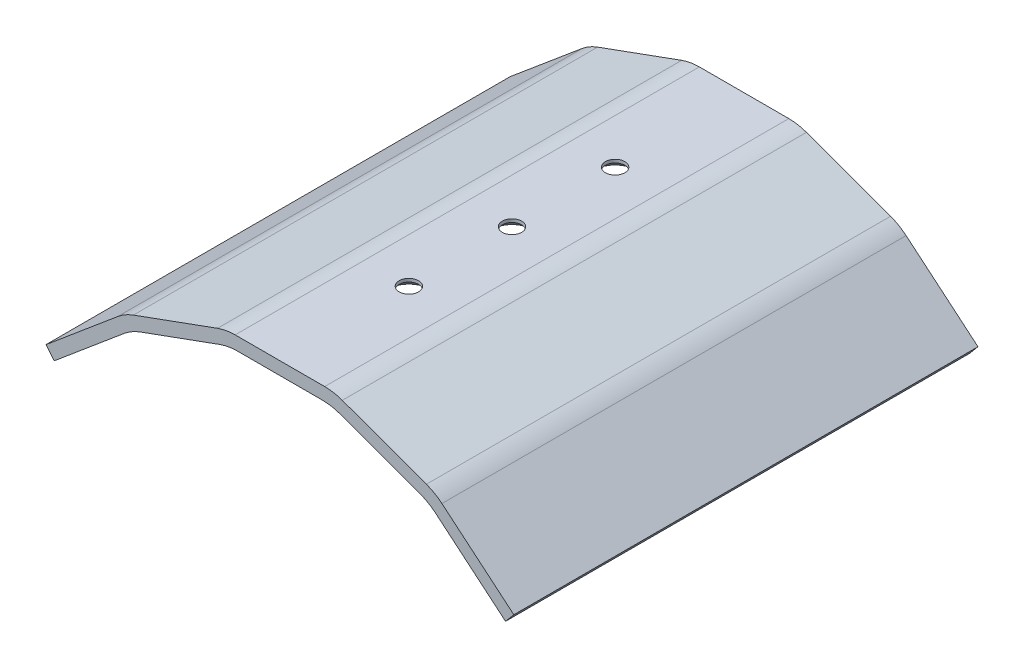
ISO-10303-21;
HEADER;
FILE_DESCRIPTION(('STEP AP214'),'2;1');
FILE_NAME('part.step','',(''),(''),'','','');
FILE_SCHEMA(('AUTOMOTIVE_DESIGN { 1 0 10303 214 1 1 1 1 }'));
ENDSEC;
DATA;
#1=APPLICATION_CONTEXT('core data for automotive mechanical design processes');
#2=APPLICATION_PROTOCOL_DEFINITION('international standard','automotive_design',2000,#1);
#3=PRODUCT_CONTEXT('',#1,'mechanical');
#4=PRODUCT('Part','Part','',(#3));
#5=PRODUCT_RELATED_PRODUCT_CATEGORY('part','',(#4));
#6=PRODUCT_DEFINITION_FORMATION('','',#4);
#7=PRODUCT_DEFINITION_CONTEXT('part definition',#1,'design');
#8=PRODUCT_DEFINITION('design','',#6,#7);
#9=PRODUCT_DEFINITION_SHAPE('','',#8);
#10=(LENGTH_UNIT() NAMED_UNIT(*) SI_UNIT(.MILLI.,.METRE.));
#11=(NAMED_UNIT(*) PLANE_ANGLE_UNIT() SI_UNIT($,.RADIAN.));
#12=(NAMED_UNIT(*) SI_UNIT($,.STERADIAN.) SOLID_ANGLE_UNIT());
#13=UNCERTAINTY_MEASURE_WITH_UNIT(LENGTH_MEASURE(1.E-05),#10,'distance_accuracy_value','');
#14=(GEOMETRIC_REPRESENTATION_CONTEXT(3) GLOBAL_UNCERTAINTY_ASSIGNED_CONTEXT((#13)) GLOBAL_UNIT_ASSIGNED_CONTEXT((#10,
#11,#12)) REPRESENTATION_CONTEXT('',''));
#15=CARTESIAN_POINT('',(0.,0.,0.));
#16=DIRECTION('',(0.,0.,1.));
#17=DIRECTION('',(1.,0.,0.));
#18=AXIS2_PLACEMENT_3D('',#15,#16,#17);
#19=CARTESIAN_POINT('',(0.,0.,114.3));
#20=DIRECTION('',(0.,1.,0.));
#21=DIRECTION('',(0.,0.,1.));
#22=AXIS2_PLACEMENT_3D('',#19,#20,#21);
#23=PLANE('',#22);
#24=CARTESIAN_POINT('',(0.,0.,31.75));
#25=DIRECTION('',(0.,1.,0.));
#26=DIRECTION('',(0.,0.,1.));
#27=AXIS2_PLACEMENT_3D('',#24,#25,#26);
#28=CIRCLE('',#27,5.13421960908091);
#29=CARTESIAN_POINT('',(0.,0.,36.8842196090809));
#30=VERTEX_POINT('',#29);
#31=EDGE_CURVE('E353',#30,#30,#28,.T.);
#32=ORIENTED_EDGE('',*,*,#31,.T.);
#33=EDGE_LOOP('',(#32));
#34=FACE_BOUND('',#33,.T.);
#35=CARTESIAN_POINT('',(0.,0.,57.15));
#36=DIRECTION('',(0.,1.,0.));
#37=DIRECTION('',(0.,0.,1.));
#38=AXIS2_PLACEMENT_3D('',#35,#36,#37);
#39=CIRCLE('',#38,5.13421960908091);
#40=CARTESIAN_POINT('',(0.,0.,62.2842196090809));
#41=VERTEX_POINT('',#40);
#42=EDGE_CURVE('E350',#41,#41,#39,.T.);
#43=ORIENTED_EDGE('',*,*,#42,.T.);
#44=EDGE_LOOP('',(#43));
#45=FACE_BOUND('',#44,.T.);
#46=CARTESIAN_POINT('',(0.,0.,82.55));
#47=DIRECTION('',(0.,1.,0.));
#48=DIRECTION('',(0.,0.,1.));
#49=AXIS2_PLACEMENT_3D('',#46,#47,#48);
#50=CIRCLE('',#49,5.13421960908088);
#51=CARTESIAN_POINT('',(0.,0.,87.6842196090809));
#52=VERTEX_POINT('',#51);
#53=EDGE_CURVE('E339',#52,#52,#50,.T.);
#54=ORIENTED_EDGE('',*,*,#53,.T.);
#55=EDGE_LOOP('',(#54));
#56=FACE_BOUND('',#55,.T.);
#57=DIRECTION('',(1.,0.,0.));
#58=VECTOR('',#57,1.);
#59=CARTESIAN_POINT('',(-12.7,0.,114.3));
#60=LINE('',#59,#58);
#61=CARTESIAN_POINT('',(-10.4606473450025,0.,114.3));
#62=VERTEX_POINT('',#61);
#63=CARTESIAN_POINT('',(10.4606473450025,0.,114.3));
#64=VERTEX_POINT('',#63);
#65=EDGE_CURVE('E265',#62,#64,#60,.T.);
#66=ORIENTED_EDGE('',*,*,#65,.F.);
#67=DIRECTION('',(0.,0.,-1.));
#68=VECTOR('',#67,1.);
#69=CARTESIAN_POINT('',(-10.4606473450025,0.,0.));
#70=LINE('',#69,#68);
#71=CARTESIAN_POINT('',(-10.4606473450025,0.,0.));
#72=VERTEX_POINT('',#71);
#73=EDGE_CURVE('E280',#62,#72,#70,.T.);
#74=ORIENTED_EDGE('',*,*,#73,.T.);
#75=DIRECTION('',(1.,0.,0.));
#76=VECTOR('',#75,1.);
#77=CARTESIAN_POINT('',(0.,0.,0.));
#78=LINE('',#77,#76);
#79=CARTESIAN_POINT('',(10.4606473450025,0.,0.));
#80=VERTEX_POINT('',#79);
#81=EDGE_CURVE('E234',#72,#80,#78,.T.);
#82=ORIENTED_EDGE('',*,*,#81,.T.);
#83=DIRECTION('',(0.,0.,-1.));
#84=VECTOR('',#83,1.);
#85=CARTESIAN_POINT('',(10.4606473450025,0.,114.3));
#86=LINE('',#85,#84);
#87=EDGE_CURVE('E278',#80,#64,#86,.F.);
#88=ORIENTED_EDGE('',*,*,#87,.T.);
#89=EDGE_LOOP('',(#66,#74,#82,#88));
#90=FACE_BOUND('',#89,.T.);
#91=ADVANCED_FACE('F45',(#34,#45,#56,#90),#23,.F.);
#92=CARTESIAN_POINT('',(13.2598381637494,3.175,114.3));
#93=DIRECTION('',(0.,-1.,0.));
#94=DIRECTION('',(0.,0.,-1.));
#95=AXIS2_PLACEMENT_3D('',#92,#93,#94);
#96=PLANE('',#95);
#97=CARTESIAN_POINT('',(0.,3.175,57.15));
#98=DIRECTION('',(0.,-1.,0.));
#99=DIRECTION('',(0.,0.,-1.));
#100=AXIS2_PLACEMENT_3D('',#97,#98,#99);
#101=CIRCLE('',#100,2.3876);
#102=CARTESIAN_POINT('',(0.,3.175,54.7624));
#103=VERTEX_POINT('',#102);
#104=EDGE_CURVE('E342',#103,#103,#101,.F.);
#105=ORIENTED_EDGE('',*,*,#104,.F.);
#106=EDGE_LOOP('',(#105));
#107=FACE_BOUND('',#106,.T.);
#108=DIRECTION('',(-1.,0.,0.));
#109=VECTOR('',#108,1.);
#110=CARTESIAN_POINT('',(13.2598381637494,3.175,114.3));
#111=LINE('',#110,#109);
#112=CARTESIAN_POINT('',(11.0204855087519,3.175,114.3));
#113=VERTEX_POINT('',#112);
#114=CARTESIAN_POINT('',(-11.0204855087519,3.175,114.3));
#115=VERTEX_POINT('',#114);
#116=EDGE_CURVE('E218',#113,#115,#111,.T.);
#117=ORIENTED_EDGE('',*,*,#116,.F.);
#118=DIRECTION('',(0.,0.,-1.));
#119=VECTOR('',#118,1.);
#120=CARTESIAN_POINT('',(11.0204855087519,3.175,114.3));
#121=LINE('',#120,#119);
#122=CARTESIAN_POINT('',(11.0204855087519,3.175,0.));
#123=VERTEX_POINT('',#122);
#124=EDGE_CURVE('E314',#113,#123,#121,.T.);
#125=ORIENTED_EDGE('',*,*,#124,.T.);
#126=DIRECTION('',(-1.,0.,0.));
#127=VECTOR('',#126,1.);
#128=CARTESIAN_POINT('',(13.2598381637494,3.175,0.));
#129=LINE('',#128,#127);
#130=CARTESIAN_POINT('',(-11.0204855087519,3.175,0.));
#131=VERTEX_POINT('',#130);
#132=EDGE_CURVE('E250',#123,#131,#129,.T.);
#133=ORIENTED_EDGE('',*,*,#132,.T.);
#134=DIRECTION('',(0.,0.,-1.));
#135=VECTOR('',#134,1.);
#136=CARTESIAN_POINT('',(-11.0204855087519,3.175,114.3));
#137=LINE('',#136,#135);
#138=EDGE_CURVE('E312',#131,#115,#137,.F.);
#139=ORIENTED_EDGE('',*,*,#138,.T.);
#140=EDGE_LOOP('',(#117,#125,#133,#139));
#141=FACE_BOUND('',#140,.T.);
#142=CARTESIAN_POINT('',(0.,3.175,31.75));
#143=DIRECTION('',(0.,-1.,0.));
#144=DIRECTION('',(0.,0.,-1.));
#145=AXIS2_PLACEMENT_3D('',#142,#143,#144);
#146=CIRCLE('',#145,2.3876);
#147=CARTESIAN_POINT('',(0.,3.175,29.3624));
#148=VERTEX_POINT('',#147);
#149=EDGE_CURVE('E238',#148,#148,#146,.F.);
#150=ORIENTED_EDGE('',*,*,#149,.F.);
#151=EDGE_LOOP('',(#150));
#152=FACE_BOUND('',#151,.T.);
#153=CARTESIAN_POINT('',(0.,3.175,82.55));
#154=DIRECTION('',(0.,-1.,0.));
#155=DIRECTION('',(0.,0.,-1.));
#156=AXIS2_PLACEMENT_3D('',#153,#154,#155);
#157=CIRCLE('',#156,2.3876);
#158=CARTESIAN_POINT('',(0.,3.175,80.1624));
#159=VERTEX_POINT('',#158);
#160=EDGE_CURVE('E345',#159,#159,#157,.F.);
#161=ORIENTED_EDGE('',*,*,#160,.F.);
#162=EDGE_LOOP('',(#161));
#163=FACE_BOUND('',#162,.T.);
#164=ADVANCED_FACE('F372',(#107,#141,#152,#163),#96,.F.);
#165=CARTESIAN_POINT('',(12.7,0.,114.3));
#166=DIRECTION('',(0.34202014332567,0.939692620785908,0.));
#167=DIRECTION('',(-0.939692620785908,0.34202014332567,0.));
#168=AXIS2_PLACEMENT_3D('',#165,#166,#167);
#169=PLANE('',#168);
#170=DIRECTION('',(0.939692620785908,-0.34202014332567,0.));
#171=VECTOR('',#170,1.);
#172=CARTESIAN_POINT('',(12.7,0.,114.3));
#173=LINE('',#172,#171);
#174=CARTESIAN_POINT('',(14.8043031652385,-0.765903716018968,114.3));
#175=VERTEX_POINT('',#174);
#176=CARTESIAN_POINT('',(34.4638894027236,-7.92140792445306,114.3));
#177=VERTEX_POINT('',#176);
#178=EDGE_CURVE('E195',#175,#177,#173,.T.);
#179=ORIENTED_EDGE('',*,*,#178,.F.);
#180=DIRECTION('',(0.,0.,-1.));
#181=VECTOR('',#180,1.);
#182=CARTESIAN_POINT('',(14.8043031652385,-0.765903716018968,0.));
#183=LINE('',#182,#181);
#184=CARTESIAN_POINT('',(14.8043031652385,-0.765903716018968,0.));
#185=VERTEX_POINT('',#184);
#186=EDGE_CURVE('E285',#175,#185,#183,.T.);
#187=ORIENTED_EDGE('',*,*,#186,.T.);
#188=DIRECTION('',(0.939692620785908,-0.34202014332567,0.));
#189=VECTOR('',#188,1.);
#190=CARTESIAN_POINT('',(12.7,0.,0.));
#191=LINE('',#190,#189);
#192=CARTESIAN_POINT('',(34.4638894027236,-7.92140792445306,0.));
#193=VERTEX_POINT('',#192);
#194=EDGE_CURVE('E237',#185,#193,#191,.T.);
#195=ORIENTED_EDGE('',*,*,#194,.T.);
#196=DIRECTION('',(0.,0.,-1.));
#197=VECTOR('',#196,1.);
#198=CARTESIAN_POINT('',(34.4638894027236,-7.92140792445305,114.3));
#199=LINE('',#198,#197);
#200=EDGE_CURVE('E283',#193,#177,#199,.F.);
#201=ORIENTED_EDGE('',*,*,#200,.T.);
#202=EDGE_LOOP('',(#179,#187,#195,#201));
#203=FACE_BOUND('',#202,.T.);
#204=ADVANCED_FACE('F448',(#203),#169,.F.);
#205=CARTESIAN_POINT('',(36.5681925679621,-8.68731164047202,114.3));
#206=DIRECTION('',(0.642787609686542,0.766044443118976,0.));
#207=DIRECTION('',(-0.766044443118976,0.642787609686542,0.));
#208=AXIS2_PLACEMENT_3D('',#205,#206,#207);
#209=PLANE('',#208);
#210=DIRECTION('',(0.766044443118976,-0.642787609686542,0.));
#211=VECTOR('',#210,1.);
#212=CARTESIAN_POINT('',(36.5681925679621,-8.68731164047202,114.3));
#213=LINE('',#212,#211);
#214=CARTESIAN_POINT('',(38.2836362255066,-10.1267397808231,114.3));
#215=VERTEX_POINT('',#214);
#216=CARTESIAN_POINT('',(55.5625,-24.625428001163,114.3));
#217=VERTEX_POINT('',#216);
#218=EDGE_CURVE('E182',#215,#217,#213,.T.);
#219=ORIENTED_EDGE('',*,*,#218,.F.);
#220=DIRECTION('',(0.,0.,-1.));
#221=VECTOR('',#220,1.);
#222=CARTESIAN_POINT('',(38.2836362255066,-10.1267397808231,0.));
#223=LINE('',#222,#221);
#224=CARTESIAN_POINT('',(38.2836362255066,-10.1267397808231,0.));
#225=VERTEX_POINT('',#224);
#226=EDGE_CURVE('E288',#215,#225,#223,.T.);
#227=ORIENTED_EDGE('',*,*,#226,.T.);
#228=DIRECTION('',(0.766044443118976,-0.642787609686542,0.));
#229=VECTOR('',#228,1.);
#230=CARTESIAN_POINT('',(36.5681925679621,-8.68731164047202,0.));
#231=LINE('',#230,#229);
#232=CARTESIAN_POINT('',(55.5625,-24.625428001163,0.));
#233=VERTEX_POINT('',#232);
#234=EDGE_CURVE('E201',#225,#233,#231,.T.);
#235=ORIENTED_EDGE('',*,*,#234,.T.);
#236=DIRECTION('',(0.,0.,-1.));
#237=VECTOR('',#236,1.);
#238=CARTESIAN_POINT('',(55.5625,-24.625428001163,114.3));
#239=LINE('',#238,#237);
#240=EDGE_CURVE('E198',#217,#233,#239,.T.);
#241=ORIENTED_EDGE('',*,*,#240,.F.);
#242=EDGE_LOOP('',(#219,#227,#235,#241));
#243=FACE_BOUND('',#242,.T.);
#244=ADVANCED_FACE('F199',(#243),#209,.F.);
#245=CARTESIAN_POINT('',(55.5625,-24.625428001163,114.3));
#246=DIRECTION('',(-0.766044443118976,0.642787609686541,0.));
#247=DIRECTION('',(-0.642787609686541,-0.766044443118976,0.));
#248=AXIS2_PLACEMENT_3D('',#245,#246,#247);
#249=PLANE('',#248);
#250=DIRECTION('',(0.642787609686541,0.766044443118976,0.));
#251=VECTOR('',#250,1.);
#252=CARTESIAN_POINT('',(55.5625,-24.625428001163,0.));
#253=LINE('',#252,#251);
#254=CARTESIAN_POINT('',(57.6033506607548,-22.1932368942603,0.));
#255=VERTEX_POINT('',#254);
#256=EDGE_CURVE('E242',#233,#255,#253,.T.);
#257=ORIENTED_EDGE('',*,*,#256,.T.);
#258=DIRECTION('',(0.,0.,-1.));
#259=VECTOR('',#258,1.);
#260=CARTESIAN_POINT('',(57.6033506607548,-22.1932368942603,114.3));
#261=LINE('',#260,#259);
#262=CARTESIAN_POINT('',(57.6033506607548,-22.1932368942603,114.3));
#263=VERTEX_POINT('',#262);
#264=EDGE_CURVE('E205',#263,#255,#261,.T.);
#265=ORIENTED_EDGE('',*,*,#264,.F.);
#266=DIRECTION('',(0.642787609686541,0.766044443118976,0.));
#267=VECTOR('',#266,1.);
#268=CARTESIAN_POINT('',(55.5625,-24.625428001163,114.3));
#269=LINE('',#268,#267);
#270=EDGE_CURVE('E187',#217,#263,#269,.T.);
#271=ORIENTED_EDGE('',*,*,#270,.F.);
#272=ORIENTED_EDGE('',*,*,#240,.T.);
#273=EDGE_LOOP('',(#257,#265,#271,#272));
#274=FACE_BOUND('',#273,.T.);
#275=ADVANCED_FACE('F207',(#274),#249,.F.);
#276=CARTESIAN_POINT('',(57.6033506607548,-22.1932368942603,114.3));
#277=DIRECTION('',(-0.642787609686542,-0.766044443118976,0.));
#278=DIRECTION('',(0.766044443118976,-0.642787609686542,0.));
#279=AXIS2_PLACEMENT_3D('',#276,#277,#278);
#280=PLANE('',#279);
#281=DIRECTION('',(-0.766044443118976,0.642787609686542,0.));
#282=VECTOR('',#281,1.);
#283=CARTESIAN_POINT('',(57.6033506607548,-22.1932368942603,0.));
#284=LINE('',#283,#282);
#285=CARTESIAN_POINT('',(39.8956259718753,-7.33469163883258,0.));
#286=VERTEX_POINT('',#285);
#287=EDGE_CURVE('E244',#255,#286,#284,.T.);
#288=ORIENTED_EDGE('',*,*,#287,.T.);
#289=DIRECTION('',(0.,0.,-1.));
#290=VECTOR('',#289,1.);
#291=CARTESIAN_POINT('',(39.8956259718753,-7.33469163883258,114.3));
#292=LINE('',#291,#290);
#293=CARTESIAN_POINT('',(39.8956259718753,-7.33469163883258,114.3));
#294=VERTEX_POINT('',#293);
#295=EDGE_CURVE('E303',#286,#294,#292,.F.);
#296=ORIENTED_EDGE('',*,*,#295,.T.);
#297=DIRECTION('',(-0.766044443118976,0.642787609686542,0.));
#298=VECTOR('',#297,1.);
#299=CARTESIAN_POINT('',(57.6033506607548,-22.1932368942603,114.3));
#300=LINE('',#299,#298);
#301=EDGE_CURVE('E210',#263,#294,#300,.T.);
#302=ORIENTED_EDGE('',*,*,#301,.F.);
#303=ORIENTED_EDGE('',*,*,#264,.T.);
#304=EDGE_LOOP('',(#288,#296,#302,#303));
#305=FACE_BOUND('',#304,.T.);
#306=ADVANCED_FACE('F467',(#305),#280,.F.);
#307=CARTESIAN_POINT('',(38.1801823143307,-5.89526349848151,114.3));
#308=DIRECTION('',(-0.34202014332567,-0.939692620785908,0.));
#309=DIRECTION('',(0.939692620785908,-0.34202014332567,0.));
#310=AXIS2_PLACEMENT_3D('',#307,#308,#309);
#311=PLANE('',#310);
#312=DIRECTION('',(-0.939692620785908,0.34202014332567,0.));
#313=VECTOR('',#312,1.);
#314=CARTESIAN_POINT('',(38.1801823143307,-5.89526349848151,114.3));
#315=LINE('',#314,#313);
#316=CARTESIAN_POINT('',(36.0758791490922,-5.12935978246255,114.3));
#317=VERTEX_POINT('',#316);
#318=CARTESIAN_POINT('',(15.3641413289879,2.40909628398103,114.3));
#319=VERTEX_POINT('',#318);
#320=EDGE_CURVE('E212',#317,#319,#315,.T.);
#321=ORIENTED_EDGE('',*,*,#320,.F.);
#322=DIRECTION('',(0.,0.,-1.));
#323=VECTOR('',#322,1.);
#324=CARTESIAN_POINT('',(36.0758791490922,-5.12935978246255,114.3));
#325=LINE('',#324,#323);
#326=CARTESIAN_POINT('',(36.0758791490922,-5.12935978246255,0.));
#327=VERTEX_POINT('',#326);
#328=EDGE_CURVE('E292',#317,#327,#325,.T.);
#329=ORIENTED_EDGE('',*,*,#328,.T.);
#330=DIRECTION('',(-0.939692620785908,0.34202014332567,0.));
#331=VECTOR('',#330,1.);
#332=CARTESIAN_POINT('',(38.1801823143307,-5.89526349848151,0.));
#333=LINE('',#332,#331);
#334=CARTESIAN_POINT('',(15.3641413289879,2.40909628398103,0.));
#335=VERTEX_POINT('',#334);
#336=EDGE_CURVE('E247',#327,#335,#333,.T.);
#337=ORIENTED_EDGE('',*,*,#336,.T.);
#338=DIRECTION('',(0.,0.,-1.));
#339=VECTOR('',#338,1.);
#340=CARTESIAN_POINT('',(15.3641413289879,2.40909628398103,114.3));
#341=LINE('',#340,#339);
#342=EDGE_CURVE('E290',#335,#319,#341,.F.);
#343=ORIENTED_EDGE('',*,*,#342,.T.);
#344=EDGE_LOOP('',(#321,#329,#337,#343));
#345=FACE_BOUND('',#344,.T.);
#346=ADVANCED_FACE('F464',(#345),#311,.F.);
#347=CARTESIAN_POINT('',(-13.2598381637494,3.175,114.3));
#348=DIRECTION('',(0.34202014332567,-0.939692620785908,0.));
#349=DIRECTION('',(0.939692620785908,0.34202014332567,0.));
#350=AXIS2_PLACEMENT_3D('',#347,#348,#349);
#351=PLANE('',#350);
#352=DIRECTION('',(-0.939692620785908,-0.34202014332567,0.));
#353=VECTOR('',#352,1.);
#354=CARTESIAN_POINT('',(-13.2598381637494,3.175,114.3));
#355=LINE('',#354,#353);
#356=CARTESIAN_POINT('',(-15.3641413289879,2.40909628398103,114.3));
#357=VERTEX_POINT('',#356);
#358=CARTESIAN_POINT('',(-36.0758791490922,-5.12935978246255,114.3));
#359=VERTEX_POINT('',#358);
#360=EDGE_CURVE('E221',#357,#359,#355,.T.);
#361=ORIENTED_EDGE('',*,*,#360,.F.);
#362=DIRECTION('',(0.,0.,-1.));
#363=VECTOR('',#362,1.);
#364=CARTESIAN_POINT('',(-15.3641413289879,2.40909628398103,114.3));
#365=LINE('',#364,#363);
#366=CARTESIAN_POINT('',(-15.3641413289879,2.40909628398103,0.));
#367=VERTEX_POINT('',#366);
#368=EDGE_CURVE('E318',#357,#367,#365,.T.);
#369=ORIENTED_EDGE('',*,*,#368,.T.);
#370=DIRECTION('',(-0.939692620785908,-0.34202014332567,0.));
#371=VECTOR('',#370,1.);
#372=CARTESIAN_POINT('',(-13.2598381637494,3.175,0.));
#373=LINE('',#372,#371);
#374=CARTESIAN_POINT('',(-36.0758791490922,-5.12935978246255,0.));
#375=VERTEX_POINT('',#374);
#376=EDGE_CURVE('E253',#367,#375,#373,.T.);
#377=ORIENTED_EDGE('',*,*,#376,.T.);
#378=DIRECTION('',(0.,0.,-1.));
#379=VECTOR('',#378,1.);
#380=CARTESIAN_POINT('',(-36.0758791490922,-5.12935978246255,114.3));
#381=LINE('',#380,#379);
#382=EDGE_CURVE('E68',#375,#359,#381,.F.);
#383=ORIENTED_EDGE('',*,*,#382,.T.);
#384=EDGE_LOOP('',(#361,#369,#377,#383));
#385=FACE_BOUND('',#384,.T.);
#386=ADVANCED_FACE('F462',(#385),#351,.F.);
#387=CARTESIAN_POINT('',(-38.1801823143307,-5.89526349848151,114.3));
#388=DIRECTION('',(0.642787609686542,-0.766044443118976,0.));
#389=DIRECTION('',(0.766044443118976,0.642787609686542,0.));
#390=AXIS2_PLACEMENT_3D('',#387,#388,#389);
#391=PLANE('',#390);
#392=DIRECTION('',(-0.766044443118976,-0.642787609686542,0.));
#393=VECTOR('',#392,1.);
#394=CARTESIAN_POINT('',(-38.1801823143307,-5.89526349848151,114.3));
#395=LINE('',#394,#393);
#396=CARTESIAN_POINT('',(-39.8956259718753,-7.33469163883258,114.3));
#397=VERTEX_POINT('',#396);
#398=CARTESIAN_POINT('',(-57.6033506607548,-22.1932368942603,114.3));
#399=VERTEX_POINT('',#398);
#400=EDGE_CURVE('E223',#397,#399,#395,.T.);
#401=ORIENTED_EDGE('',*,*,#400,.F.);
#402=DIRECTION('',(0.,0.,-1.));
#403=VECTOR('',#402,1.);
#404=CARTESIAN_POINT('',(-39.8956259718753,-7.33469163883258,114.3));
#405=LINE('',#404,#403);
#406=CARTESIAN_POINT('',(-39.8956259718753,-7.33469163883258,0.));
#407=VERTEX_POINT('',#406);
#408=EDGE_CURVE('E321',#397,#407,#405,.T.);
#409=ORIENTED_EDGE('',*,*,#408,.T.);
#410=DIRECTION('',(-0.766044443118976,-0.642787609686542,0.));
#411=VECTOR('',#410,1.);
#412=CARTESIAN_POINT('',(-38.1801823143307,-5.89526349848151,0.));
#413=LINE('',#412,#411);
#414=CARTESIAN_POINT('',(-57.6033506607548,-22.1932368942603,0.));
#415=VERTEX_POINT('',#414);
#416=EDGE_CURVE('E255',#407,#415,#413,.T.);
#417=ORIENTED_EDGE('',*,*,#416,.T.);
#418=DIRECTION('',(0.,0.,-1.));
#419=VECTOR('',#418,1.);
#420=CARTESIAN_POINT('',(-57.6033506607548,-22.1932368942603,114.3));
#421=LINE('',#420,#419);
#422=EDGE_CURVE('E268',#399,#415,#421,.T.);
#423=ORIENTED_EDGE('',*,*,#422,.F.);
#424=EDGE_LOOP('',(#401,#409,#417,#423));
#425=FACE_BOUND('',#424,.T.);
#426=ADVANCED_FACE('F413',(#425),#391,.F.);
#427=CARTESIAN_POINT('',(-57.6033506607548,-22.1932368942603,114.3));
#428=DIRECTION('',(0.766044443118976,0.642787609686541,0.));
#429=DIRECTION('',(-0.642787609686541,0.766044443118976,0.));
#430=AXIS2_PLACEMENT_3D('',#427,#428,#429);
#431=PLANE('',#430);
#432=DIRECTION('',(0.642787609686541,-0.766044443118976,0.));
#433=VECTOR('',#432,1.);
#434=CARTESIAN_POINT('',(-57.6033506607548,-22.1932368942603,0.));
#435=LINE('',#434,#433);
#436=CARTESIAN_POINT('',(-55.5625,-24.625428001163,0.));
#437=VERTEX_POINT('',#436);
#438=EDGE_CURVE('E257',#415,#437,#435,.T.);
#439=ORIENTED_EDGE('',*,*,#438,.T.);
#440=DIRECTION('',(0.,0.,-1.));
#441=VECTOR('',#440,1.);
#442=CARTESIAN_POINT('',(-55.5625,-24.625428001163,114.3));
#443=LINE('',#442,#441);
#444=CARTESIAN_POINT('',(-55.5625,-24.625428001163,114.3));
#445=VERTEX_POINT('',#444);
#446=EDGE_CURVE('E233',#445,#437,#443,.T.);
#447=ORIENTED_EDGE('',*,*,#446,.F.);
#448=DIRECTION('',(0.642787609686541,-0.766044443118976,0.));
#449=VECTOR('',#448,1.);
#450=CARTESIAN_POINT('',(-57.6033506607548,-22.1932368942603,114.3));
#451=LINE('',#450,#449);
#452=EDGE_CURVE('E225',#399,#445,#451,.T.);
#453=ORIENTED_EDGE('',*,*,#452,.F.);
#454=ORIENTED_EDGE('',*,*,#422,.T.);
#455=EDGE_LOOP('',(#439,#447,#453,#454));
#456=FACE_BOUND('',#455,.T.);
#457=ADVANCED_FACE('F408',(#456),#431,.F.);
#458=CARTESIAN_POINT('',(-55.5625,-24.625428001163,114.3));
#459=DIRECTION('',(-0.642787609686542,0.766044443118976,0.));
#460=DIRECTION('',(-0.766044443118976,-0.642787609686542,0.));
#461=AXIS2_PLACEMENT_3D('',#458,#459,#460);
#462=PLANE('',#461);
#463=DIRECTION('',(0.766044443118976,0.642787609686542,0.));
#464=VECTOR('',#463,1.);
#465=CARTESIAN_POINT('',(-55.5625,-24.625428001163,0.));
#466=LINE('',#465,#464);
#467=CARTESIAN_POINT('',(-38.2836362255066,-10.1267397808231,0.));
#468=VERTEX_POINT('',#467);
#469=EDGE_CURVE('E259',#437,#468,#466,.T.);
#470=ORIENTED_EDGE('',*,*,#469,.T.);
#471=DIRECTION('',(0.,0.,-1.));
#472=VECTOR('',#471,1.);
#473=CARTESIAN_POINT('',(-38.2836362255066,-10.1267397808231,114.3));
#474=LINE('',#473,#472);
#475=CARTESIAN_POINT('',(-38.2836362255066,-10.1267397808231,114.3));
#476=VERTEX_POINT('',#475);
#477=EDGE_CURVE('E276',#468,#476,#474,.F.);
#478=ORIENTED_EDGE('',*,*,#477,.T.);
#479=DIRECTION('',(0.766044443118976,0.642787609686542,0.));
#480=VECTOR('',#479,1.);
#481=CARTESIAN_POINT('',(-55.5625,-24.625428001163,114.3));
#482=LINE('',#481,#480);
#483=EDGE_CURVE('E227',#445,#476,#482,.T.);
#484=ORIENTED_EDGE('',*,*,#483,.F.);
#485=ORIENTED_EDGE('',*,*,#446,.T.);
#486=EDGE_LOOP('',(#470,#478,#484,#485));
#487=FACE_BOUND('',#486,.T.);
#488=ADVANCED_FACE('F403',(#487),#462,.F.);
#489=CARTESIAN_POINT('',(-36.5681925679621,-8.68731164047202,114.3));
#490=DIRECTION('',(-0.34202014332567,0.939692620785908,0.));
#491=DIRECTION('',(-0.939692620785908,-0.34202014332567,0.));
#492=AXIS2_PLACEMENT_3D('',#489,#490,#491);
#493=PLANE('',#492);
#494=DIRECTION('',(0.939692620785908,0.34202014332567,0.));
#495=VECTOR('',#494,1.);
#496=CARTESIAN_POINT('',(-36.5681925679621,-8.68731164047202,114.3));
#497=LINE('',#496,#495);
#498=CARTESIAN_POINT('',(-34.4638894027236,-7.92140792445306,114.3));
#499=VERTEX_POINT('',#498);
#500=CARTESIAN_POINT('',(-14.8043031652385,-0.765903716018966,114.3));
#501=VERTEX_POINT('',#500);
#502=EDGE_CURVE('E230',#499,#501,#497,.T.);
#503=ORIENTED_EDGE('',*,*,#502,.F.);
#504=DIRECTION('',(0.,0.,-1.));
#505=VECTOR('',#504,1.);
#506=CARTESIAN_POINT('',(-34.4638894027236,-7.92140792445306,0.));
#507=LINE('',#506,#505);
#508=CARTESIAN_POINT('',(-34.4638894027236,-7.92140792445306,0.));
#509=VERTEX_POINT('',#508);
#510=EDGE_CURVE('E273',#499,#509,#507,.T.);
#511=ORIENTED_EDGE('',*,*,#510,.T.);
#512=DIRECTION('',(0.939692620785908,0.34202014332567,0.));
#513=VECTOR('',#512,1.);
#514=CARTESIAN_POINT('',(-36.5681925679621,-8.68731164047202,0.));
#515=LINE('',#514,#513);
#516=CARTESIAN_POINT('',(-14.8043031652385,-0.765903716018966,0.));
#517=VERTEX_POINT('',#516);
#518=EDGE_CURVE('E262',#509,#517,#515,.T.);
#519=ORIENTED_EDGE('',*,*,#518,.T.);
#520=DIRECTION('',(0.,0.,-1.));
#521=VECTOR('',#520,1.);
#522=CARTESIAN_POINT('',(-14.8043031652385,-0.765903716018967,114.3));
#523=LINE('',#522,#521);
#524=EDGE_CURVE('E204',#517,#501,#523,.F.);
#525=ORIENTED_EDGE('',*,*,#524,.T.);
#526=EDGE_LOOP('',(#503,#511,#519,#525));
#527=FACE_BOUND('',#526,.T.);
#528=ADVANCED_FACE('F394',(#527),#493,.F.);
#529=CARTESIAN_POINT('',(0.,0.,114.3));
#530=DIRECTION('',(0.,0.,1.));
#531=DIRECTION('',(1.,0.,0.));
#532=AXIS2_PLACEMENT_3D('',#529,#530,#531);
#533=PLANE('',#532);
#534=ORIENTED_EDGE('',*,*,#301,.T.);
#535=CARTESIAN_POINT('',(31.7322233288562,-17.0634560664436,114.3));
#536=DIRECTION('',(0.,0.,1.));
#537=DIRECTION('',(1.,0.,0.));
#538=AXIS2_PLACEMENT_3D('',#535,#536,#537);
#539=CIRCLE('',#538,12.7);
#540=EDGE_CURVE('E310',#294,#317,#539,.T.);
#541=ORIENTED_EDGE('',*,*,#540,.T.);
#542=ORIENTED_EDGE('',*,*,#320,.T.);
#543=CARTESIAN_POINT('',(11.0204855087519,-9.525,114.3));
#544=DIRECTION('',(0.,0.,1.));
#545=DIRECTION('',(1.,0.,0.));
#546=AXIS2_PLACEMENT_3D('',#543,#544,#545);
#547=CIRCLE('',#546,12.7);
#548=EDGE_CURVE('E308',#319,#113,#547,.T.);
#549=ORIENTED_EDGE('',*,*,#548,.T.);
#550=ORIENTED_EDGE('',*,*,#116,.T.);
#551=CARTESIAN_POINT('',(-11.0204855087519,-9.525,114.3));
#552=DIRECTION('',(0.,0.,1.));
#553=DIRECTION('',(1.,0.,0.));
#554=AXIS2_PLACEMENT_3D('',#551,#552,#553);
#555=CIRCLE('',#554,12.7);
#556=EDGE_CURVE('E306',#115,#357,#555,.T.);
#557=ORIENTED_EDGE('',*,*,#556,.T.);
#558=ORIENTED_EDGE('',*,*,#360,.T.);
#559=CARTESIAN_POINT('',(-31.7322233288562,-17.0634560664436,114.3));
#560=DIRECTION('',(0.,0.,1.));
#561=DIRECTION('',(1.,0.,0.));
#562=AXIS2_PLACEMENT_3D('',#559,#560,#561);
#563=CIRCLE('',#562,12.7);
#564=EDGE_CURVE('E60',#359,#397,#563,.T.);
#565=ORIENTED_EDGE('',*,*,#564,.T.);
#566=ORIENTED_EDGE('',*,*,#400,.T.);
#567=ORIENTED_EDGE('',*,*,#452,.T.);
#568=ORIENTED_EDGE('',*,*,#483,.T.);
#569=CARTESIAN_POINT('',(-30.1202335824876,-19.8555042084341,114.3));
#570=DIRECTION('',(0.,0.,1.));
#571=DIRECTION('',(1.,0.,0.));
#572=AXIS2_PLACEMENT_3D('',#569,#570,#571);
#573=CIRCLE('',#572,12.7);
#574=EDGE_CURVE('E326',#476,#499,#573,.F.);
#575=ORIENTED_EDGE('',*,*,#574,.T.);
#576=ORIENTED_EDGE('',*,*,#502,.T.);
#577=CARTESIAN_POINT('',(-10.4606473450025,-12.7,114.3));
#578=DIRECTION('',(0.,0.,1.));
#579=DIRECTION('',(1.,0.,0.));
#580=AXIS2_PLACEMENT_3D('',#577,#578,#579);
#581=CIRCLE('',#580,12.7);
#582=EDGE_CURVE('E330',#501,#62,#581,.F.);
#583=ORIENTED_EDGE('',*,*,#582,.T.);
#584=ORIENTED_EDGE('',*,*,#65,.T.);
#585=CARTESIAN_POINT('',(10.4606473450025,-12.7,114.3));
#586=DIRECTION('',(0.,0.,1.));
#587=DIRECTION('',(1.,0.,0.));
#588=AXIS2_PLACEMENT_3D('',#585,#586,#587);
#589=CIRCLE('',#588,12.7);
#590=EDGE_CURVE('E334',#64,#175,#589,.F.);
#591=ORIENTED_EDGE('',*,*,#590,.T.);
#592=ORIENTED_EDGE('',*,*,#178,.T.);
#593=CARTESIAN_POINT('',(30.1202335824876,-19.8555042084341,114.3));
#594=DIRECTION('',(0.,0.,1.));
#595=DIRECTION('',(1.,0.,0.));
#596=AXIS2_PLACEMENT_3D('',#593,#594,#595);
#597=CIRCLE('',#596,12.7);
#598=EDGE_CURVE('E191',#177,#215,#597,.F.);
#599=ORIENTED_EDGE('',*,*,#598,.T.);
#600=ORIENTED_EDGE('',*,*,#218,.T.);
#601=ORIENTED_EDGE('',*,*,#270,.T.);
#602=EDGE_LOOP('',(#534,#541,#542,#549,#550,#557,#558,#565,#566,#567,#568,#575,#576,#583,#584,
#591,#592,#599,#600,#601));
#603=FACE_BOUND('',#602,.T.);
#604=ADVANCED_FACE('F185',(#603),#533,.T.);
#605=CARTESIAN_POINT('',(0.,0.,0.));
#606=DIRECTION('',(0.,0.,1.));
#607=DIRECTION('',(1.,0.,0.));
#608=AXIS2_PLACEMENT_3D('',#605,#606,#607);
#609=PLANE('',#608);
#610=ORIENTED_EDGE('',*,*,#336,.F.);
#611=CARTESIAN_POINT('',(31.7322233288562,-17.0634560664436,0.));
#612=DIRECTION('',(0.,0.,1.));
#613=DIRECTION('',(1.,0.,0.));
#614=AXIS2_PLACEMENT_3D('',#611,#612,#613);
#615=CIRCLE('',#614,12.7);
#616=EDGE_CURVE('E301',#327,#286,#615,.F.);
#617=ORIENTED_EDGE('',*,*,#616,.T.);
#618=ORIENTED_EDGE('',*,*,#287,.F.);
#619=ORIENTED_EDGE('',*,*,#256,.F.);
#620=ORIENTED_EDGE('',*,*,#234,.F.);
#621=CARTESIAN_POINT('',(30.1202335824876,-19.8555042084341,0.));
#622=DIRECTION('',(0.,0.,1.));
#623=DIRECTION('',(1.,0.,0.));
#624=AXIS2_PLACEMENT_3D('',#621,#622,#623);
#625=CIRCLE('',#624,12.7);
#626=EDGE_CURVE('E336',#225,#193,#625,.T.);
#627=ORIENTED_EDGE('',*,*,#626,.T.);
#628=ORIENTED_EDGE('',*,*,#194,.F.);
#629=CARTESIAN_POINT('',(10.4606473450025,-12.7,0.));
#630=DIRECTION('',(0.,0.,1.));
#631=DIRECTION('',(1.,0.,0.));
#632=AXIS2_PLACEMENT_3D('',#629,#630,#631);
#633=CIRCLE('',#632,12.7);
#634=EDGE_CURVE('E332',#185,#80,#633,.T.);
#635=ORIENTED_EDGE('',*,*,#634,.T.);
#636=ORIENTED_EDGE('',*,*,#81,.F.);
#637=CARTESIAN_POINT('',(-10.4606473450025,-12.7,0.));
#638=DIRECTION('',(0.,0.,1.));
#639=DIRECTION('',(1.,0.,0.));
#640=AXIS2_PLACEMENT_3D('',#637,#638,#639);
#641=CIRCLE('',#640,12.7);
#642=EDGE_CURVE('E328',#72,#517,#641,.T.);
#643=ORIENTED_EDGE('',*,*,#642,.T.);
#644=ORIENTED_EDGE('',*,*,#518,.F.);
#645=CARTESIAN_POINT('',(-30.1202335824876,-19.8555042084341,0.));
#646=DIRECTION('',(0.,0.,1.));
#647=DIRECTION('',(1.,0.,0.));
#648=AXIS2_PLACEMENT_3D('',#645,#646,#647);
#649=CIRCLE('',#648,12.7);
#650=EDGE_CURVE('E324',#509,#468,#649,.T.);
#651=ORIENTED_EDGE('',*,*,#650,.T.);
#652=ORIENTED_EDGE('',*,*,#469,.F.);
#653=ORIENTED_EDGE('',*,*,#438,.F.);
#654=ORIENTED_EDGE('',*,*,#416,.F.);
#655=CARTESIAN_POINT('',(-31.7322233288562,-17.0634560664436,0.));
#656=DIRECTION('',(0.,0.,1.));
#657=DIRECTION('',(1.,0.,0.));
#658=AXIS2_PLACEMENT_3D('',#655,#656,#657);
#659=CIRCLE('',#658,12.7);
#660=EDGE_CURVE('E295',#407,#375,#659,.F.);
#661=ORIENTED_EDGE('',*,*,#660,.T.);
#662=ORIENTED_EDGE('',*,*,#376,.F.);
#663=CARTESIAN_POINT('',(-11.0204855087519,-9.525,0.));
#664=DIRECTION('',(0.,0.,1.));
#665=DIRECTION('',(1.,0.,0.));
#666=AXIS2_PLACEMENT_3D('',#663,#664,#665);
#667=CIRCLE('',#666,12.7);
#668=EDGE_CURVE('E297',#367,#131,#667,.F.);
#669=ORIENTED_EDGE('',*,*,#668,.T.);
#670=ORIENTED_EDGE('',*,*,#132,.F.);
#671=CARTESIAN_POINT('',(11.0204855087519,-9.525,0.));
#672=DIRECTION('',(0.,0.,1.));
#673=DIRECTION('',(1.,0.,0.));
#674=AXIS2_PLACEMENT_3D('',#671,#672,#673);
#675=CIRCLE('',#674,12.7);
#676=EDGE_CURVE('E299',#123,#335,#675,.F.);
#677=ORIENTED_EDGE('',*,*,#676,.T.);
#678=EDGE_LOOP('',(#610,#617,#618,#619,#620,#627,#628,#635,#636,#643,#644,#651,#652,#653,#654,
#661,#662,#669,#670,#677));
#679=FACE_BOUND('',#678,.T.);
#680=ADVANCED_FACE('F391',(#679),#609,.F.);
#681=CARTESIAN_POINT('',(-30.1202335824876,-19.8555042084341,114.3));
#682=DIRECTION('',(0.,0.,1.));
#683=DIRECTION('',(1.,0.,0.));
#684=AXIS2_PLACEMENT_3D('',#681,#682,#683);
#685=CYLINDRICAL_SURFACE('',#684,12.7);
#686=ORIENTED_EDGE('',*,*,#574,.F.);
#687=ORIENTED_EDGE('',*,*,#477,.F.);
#688=ORIENTED_EDGE('',*,*,#650,.F.);
#689=ORIENTED_EDGE('',*,*,#510,.F.);
#690=EDGE_LOOP('',(#686,#687,#688,#689));
#691=FACE_BOUND('',#690,.T.);
#692=ADVANCED_FACE('F398',(#691),#685,.F.);
#693=CARTESIAN_POINT('',(-10.4606473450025,-12.7,114.3));
#694=DIRECTION('',(0.,0.,1.));
#695=DIRECTION('',(1.,0.,0.));
#696=AXIS2_PLACEMENT_3D('',#693,#694,#695);
#697=CYLINDRICAL_SURFACE('',#696,12.7);
#698=ORIENTED_EDGE('',*,*,#582,.F.);
#699=ORIENTED_EDGE('',*,*,#524,.F.);
#700=ORIENTED_EDGE('',*,*,#642,.F.);
#701=ORIENTED_EDGE('',*,*,#73,.F.);
#702=EDGE_LOOP('',(#698,#699,#700,#701));
#703=FACE_BOUND('',#702,.T.);
#704=ADVANCED_FACE('F386',(#703),#697,.F.);
#705=CARTESIAN_POINT('',(10.4606473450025,-12.7,114.3));
#706=DIRECTION('',(0.,0.,1.));
#707=DIRECTION('',(1.,0.,0.));
#708=AXIS2_PLACEMENT_3D('',#705,#706,#707);
#709=CYLINDRICAL_SURFACE('',#708,12.7);
#710=ORIENTED_EDGE('',*,*,#590,.F.);
#711=ORIENTED_EDGE('',*,*,#87,.F.);
#712=ORIENTED_EDGE('',*,*,#634,.F.);
#713=ORIENTED_EDGE('',*,*,#186,.F.);
#714=EDGE_LOOP('',(#710,#711,#712,#713));
#715=FACE_BOUND('',#714,.T.);
#716=ADVANCED_FACE('F480',(#715),#709,.F.);
#717=CARTESIAN_POINT('',(30.1202335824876,-19.8555042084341,114.3));
#718=DIRECTION('',(0.,0.,1.));
#719=DIRECTION('',(1.,0.,0.));
#720=AXIS2_PLACEMENT_3D('',#717,#718,#719);
#721=CYLINDRICAL_SURFACE('',#720,12.7);
#722=ORIENTED_EDGE('',*,*,#598,.F.);
#723=ORIENTED_EDGE('',*,*,#200,.F.);
#724=ORIENTED_EDGE('',*,*,#626,.F.);
#725=ORIENTED_EDGE('',*,*,#226,.F.);
#726=EDGE_LOOP('',(#722,#723,#724,#725));
#727=FACE_BOUND('',#726,.T.);
#728=ADVANCED_FACE('F483',(#727),#721,.F.);
#729=CARTESIAN_POINT('',(31.7322233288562,-17.0634560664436,114.3));
#730=DIRECTION('',(0.,0.,-1.));
#731=DIRECTION('',(-1.,0.,0.));
#732=AXIS2_PLACEMENT_3D('',#729,#730,#731);
#733=CYLINDRICAL_SURFACE('',#732,12.7);
#734=ORIENTED_EDGE('',*,*,#540,.F.);
#735=ORIENTED_EDGE('',*,*,#295,.F.);
#736=ORIENTED_EDGE('',*,*,#616,.F.);
#737=ORIENTED_EDGE('',*,*,#328,.F.);
#738=EDGE_LOOP('',(#734,#735,#736,#737));
#739=FACE_BOUND('',#738,.T.);
#740=ADVANCED_FACE('F487',(#739),#733,.T.);
#741=CARTESIAN_POINT('',(11.0204855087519,-9.525,114.3));
#742=DIRECTION('',(0.,0.,-1.));
#743=DIRECTION('',(-1.,0.,0.));
#744=AXIS2_PLACEMENT_3D('',#741,#742,#743);
#745=CYLINDRICAL_SURFACE('',#744,12.7);
#746=ORIENTED_EDGE('',*,*,#548,.F.);
#747=ORIENTED_EDGE('',*,*,#342,.F.);
#748=ORIENTED_EDGE('',*,*,#676,.F.);
#749=ORIENTED_EDGE('',*,*,#124,.F.);
#750=EDGE_LOOP('',(#746,#747,#748,#749));
#751=FACE_BOUND('',#750,.T.);
#752=ADVANCED_FACE('F427',(#751),#745,.T.);
#753=CARTESIAN_POINT('',(-11.0204855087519,-9.525,114.3));
#754=DIRECTION('',(0.,0.,-1.));
#755=DIRECTION('',(-1.,0.,0.));
#756=AXIS2_PLACEMENT_3D('',#753,#754,#755);
#757=CYLINDRICAL_SURFACE('',#756,12.7);
#758=ORIENTED_EDGE('',*,*,#556,.F.);
#759=ORIENTED_EDGE('',*,*,#138,.F.);
#760=ORIENTED_EDGE('',*,*,#668,.F.);
#761=ORIENTED_EDGE('',*,*,#368,.F.);
#762=EDGE_LOOP('',(#758,#759,#760,#761));
#763=FACE_BOUND('',#762,.T.);
#764=ADVANCED_FACE('F419',(#763),#757,.T.);
#765=CARTESIAN_POINT('',(-31.7322233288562,-17.0634560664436,114.3));
#766=DIRECTION('',(0.,0.,-1.));
#767=DIRECTION('',(-1.,0.,0.));
#768=AXIS2_PLACEMENT_3D('',#765,#766,#767);
#769=CYLINDRICAL_SURFACE('',#768,12.7);
#770=ORIENTED_EDGE('',*,*,#564,.F.);
#771=ORIENTED_EDGE('',*,*,#382,.F.);
#772=ORIENTED_EDGE('',*,*,#660,.F.);
#773=ORIENTED_EDGE('',*,*,#408,.F.);
#774=EDGE_LOOP('',(#770,#771,#772,#773));
#775=FACE_BOUND('',#774,.T.);
#776=ADVANCED_FACE('F416',(#775),#769,.T.);
#777=CARTESIAN_POINT('',(0.,25.4,31.75));
#778=DIRECTION('',(0.,-1.,0.));
#779=DIRECTION('',(0.,0.,-1.));
#780=AXIS2_PLACEMENT_3D('',#777,#778,#779);
#781=CYLINDRICAL_SURFACE('',#780,2.3876);
#782=CARTESIAN_POINT('',(0.,2.38760000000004,31.75));
#783=DIRECTION('',(0.,1.,0.));
#784=DIRECTION('',(0.,0.,1.));
#785=AXIS2_PLACEMENT_3D('',#782,#783,#784);
#786=CIRCLE('',#785,2.3876);
#787=CARTESIAN_POINT('',(0.,2.38760000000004,34.1376));
#788=VERTEX_POINT('',#787);
#789=EDGE_CURVE('E356',#788,#788,#786,.F.);
#790=ORIENTED_EDGE('',*,*,#789,.T.);
#791=EDGE_LOOP('',(#790));
#792=FACE_BOUND('',#791,.T.);
#793=ORIENTED_EDGE('',*,*,#149,.T.);
#794=EDGE_LOOP('',(#793));
#795=FACE_BOUND('',#794,.T.);
#796=ADVANCED_FACE('F418',(#792,#795),#781,.F.);
#797=CARTESIAN_POINT('',(0.,25.4,57.15));
#798=DIRECTION('',(0.,-1.,0.));
#799=DIRECTION('',(0.,0.,-1.));
#800=AXIS2_PLACEMENT_3D('',#797,#798,#799);
#801=CYLINDRICAL_SURFACE('',#800,2.3876);
#802=CARTESIAN_POINT('',(0.,2.38760000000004,57.15));
#803=DIRECTION('',(0.,1.,0.));
#804=DIRECTION('',(0.,0.,1.));
#805=AXIS2_PLACEMENT_3D('',#802,#803,#804);
#806=CIRCLE('',#805,2.3876);
#807=CARTESIAN_POINT('',(0.,2.38760000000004,59.5376));
#808=VERTEX_POINT('',#807);
#809=EDGE_CURVE('E53',#808,#808,#806,.F.);
#810=ORIENTED_EDGE('',*,*,#809,.T.);
#811=EDGE_LOOP('',(#810));
#812=FACE_BOUND('',#811,.T.);
#813=ORIENTED_EDGE('',*,*,#104,.T.);
#814=EDGE_LOOP('',(#813));
#815=FACE_BOUND('',#814,.T.);
#816=ADVANCED_FACE('F361',(#812,#815),#801,.F.);
#817=CARTESIAN_POINT('',(0.,25.4,82.55));
#818=DIRECTION('',(0.,-1.,0.));
#819=DIRECTION('',(0.,0.,-1.));
#820=AXIS2_PLACEMENT_3D('',#817,#818,#819);
#821=CYLINDRICAL_SURFACE('',#820,2.3876);
#822=CARTESIAN_POINT('',(0.,2.38760000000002,82.55));
#823=DIRECTION('',(0.,1.,0.));
#824=DIRECTION('',(0.,0.,1.));
#825=AXIS2_PLACEMENT_3D('',#822,#823,#824);
#826=CIRCLE('',#825,2.3876);
#827=CARTESIAN_POINT('',(0.,2.38760000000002,84.9376));
#828=VERTEX_POINT('',#827);
#829=EDGE_CURVE('E13',#828,#828,#826,.F.);
#830=ORIENTED_EDGE('',*,*,#829,.T.);
#831=EDGE_LOOP('',(#830));
#832=FACE_BOUND('',#831,.T.);
#833=ORIENTED_EDGE('',*,*,#160,.T.);
#834=EDGE_LOOP('',(#833));
#835=FACE_BOUND('',#834,.T.);
#836=ADVANCED_FACE('F433',(#832,#835),#821,.F.);
#837=CARTESIAN_POINT('',(0.,0.,31.75));
#838=DIRECTION('',(0.,-1.,0.));
#839=DIRECTION('',(0.,0.,-1.));
#840=AXIS2_PLACEMENT_3D('',#837,#838,#839);
#841=CONICAL_SURFACE('',#840,5.13421960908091,0.855211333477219);
#842=ORIENTED_EDGE('',*,*,#789,.F.);
#843=EDGE_LOOP('',(#842));
#844=FACE_BOUND('',#843,.T.);
#845=ORIENTED_EDGE('',*,*,#31,.F.);
#846=EDGE_LOOP('',(#845));
#847=FACE_BOUND('',#846,.T.);
#848=ADVANCED_FACE('F367',(#844,#847),#841,.F.);
#849=CARTESIAN_POINT('',(0.,0.,57.15));
#850=DIRECTION('',(0.,-1.,0.));
#851=DIRECTION('',(0.,0.,-1.));
#852=AXIS2_PLACEMENT_3D('',#849,#850,#851);
#853=CONICAL_SURFACE('',#852,5.13421960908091,0.855211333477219);
#854=ORIENTED_EDGE('',*,*,#809,.F.);
#855=EDGE_LOOP('',(#854));
#856=FACE_BOUND('',#855,.T.);
#857=ORIENTED_EDGE('',*,*,#42,.F.);
#858=EDGE_LOOP('',(#857));
#859=FACE_BOUND('',#858,.T.);
#860=ADVANCED_FACE('F364',(#856,#859),#853,.F.);
#861=CARTESIAN_POINT('',(0.,0.,82.55));
#862=DIRECTION('',(0.,-1.,0.));
#863=DIRECTION('',(0.,0.,-1.));
#864=AXIS2_PLACEMENT_3D('',#861,#862,#863);
#865=CONICAL_SURFACE('',#864,5.13421960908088,0.855211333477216);
#866=ORIENTED_EDGE('',*,*,#829,.F.);
#867=EDGE_LOOP('',(#866));
#868=FACE_BOUND('',#867,.T.);
#869=ORIENTED_EDGE('',*,*,#53,.F.);
#870=EDGE_LOOP('',(#869));
#871=FACE_BOUND('',#870,.T.);
#872=ADVANCED_FACE('F47',(#868,#871),#865,.F.);
#873=CLOSED_SHELL('',(#91,#164,#204,#244,#275,#306,#346,#386,#426,#457,#488,#528,#604,#680,#692,
#704,#716,#728,#740,#752,#764,#776,#796,#816,#836,#848,#860,#872));
#874=MANIFOLD_SOLID_BREP('B2',#873);
#875=ADVANCED_BREP_SHAPE_REPRESENTATION('',(#18,#874),#14);
#876=SHAPE_DEFINITION_REPRESENTATION(#9,#875);
ENDSEC;
END-ISO-10303-21;
